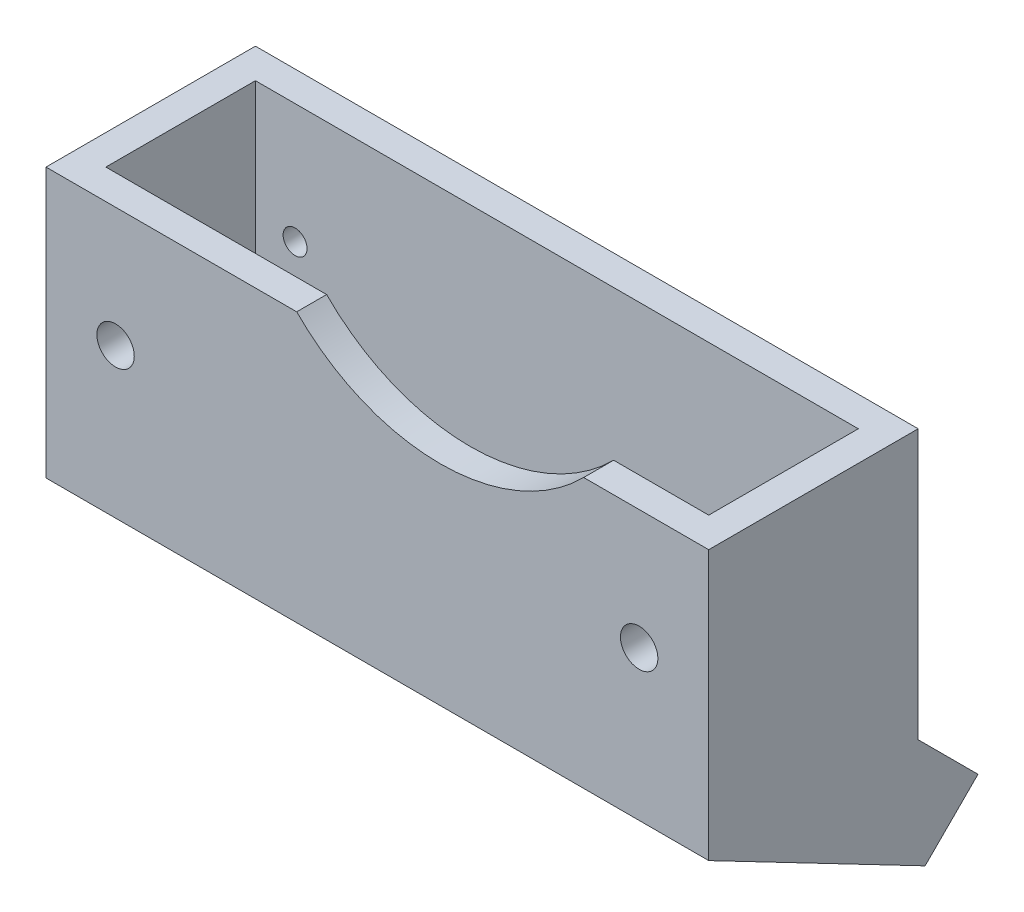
ISO-10303-21;
HEADER;
FILE_DESCRIPTION(('STEP AP214'),'2;1');
FILE_NAME('part.step','',(''),(''),'','','');
FILE_SCHEMA(('AUTOMOTIVE_DESIGN { 1 0 10303 214 1 1 1 1 }'));
ENDSEC;
DATA;
#1=APPLICATION_CONTEXT('core data for automotive mechanical design processes');
#2=APPLICATION_PROTOCOL_DEFINITION('international standard','automotive_design',2000,#1);
#3=PRODUCT_CONTEXT('',#1,'mechanical');
#4=PRODUCT('Part','Part','',(#3));
#5=PRODUCT_RELATED_PRODUCT_CATEGORY('part','',(#4));
#6=PRODUCT_DEFINITION_FORMATION('','',#4);
#7=PRODUCT_DEFINITION_CONTEXT('part definition',#1,'design');
#8=PRODUCT_DEFINITION('design','',#6,#7);
#9=PRODUCT_DEFINITION_SHAPE('','',#8);
#10=(LENGTH_UNIT() NAMED_UNIT(*) SI_UNIT(.MILLI.,.METRE.));
#11=(NAMED_UNIT(*) PLANE_ANGLE_UNIT() SI_UNIT($,.RADIAN.));
#12=(NAMED_UNIT(*) SI_UNIT($,.STERADIAN.) SOLID_ANGLE_UNIT());
#13=UNCERTAINTY_MEASURE_WITH_UNIT(LENGTH_MEASURE(1.E-05),#10,'distance_accuracy_value','');
#14=(GEOMETRIC_REPRESENTATION_CONTEXT(3) GLOBAL_UNCERTAINTY_ASSIGNED_CONTEXT((#13)) GLOBAL_UNIT_ASSIGNED_CONTEXT((#10,
#11,#12)) REPRESENTATION_CONTEXT('',''));
#15=CARTESIAN_POINT('',(0.,0.,0.));
#16=DIRECTION('',(0.,0.,1.));
#17=DIRECTION('',(1.,0.,0.));
#18=AXIS2_PLACEMENT_3D('',#15,#16,#17);
#19=CARTESIAN_POINT('',(-36.6402744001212,-23.,-10.));
#20=DIRECTION('',(0.,-0.707106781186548,0.707106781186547));
#21=DIRECTION('',(0.,-0.707106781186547,-0.707106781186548));
#22=AXIS2_PLACEMENT_3D('',#19,#20,#21);
#23=PLANE('',#22);
#24=DIRECTION('',(-0.885684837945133,0.328300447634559,0.328300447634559));
#25=VECTOR('',#24,1.);
#26=CARTESIAN_POINT('',(-21.7307374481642,-17.383159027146,-4.383159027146));
#27=LINE('',#26,#25);
#28=CARTESIAN_POINT('',(-8.15,-22.4171869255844,-9.41718692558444));
#29=VERTEX_POINT('',#28);
#30=CARTESIAN_POINT('',(-20.0666315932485,-18.,-5.));
#31=VERTEX_POINT('',#30);
#32=EDGE_CURVE('E63',#29,#31,#27,.T.);
#33=ORIENTED_EDGE('',*,*,#32,.F.);
#34=DIRECTION('',(0.,-0.707106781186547,-0.707106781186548));
#35=VECTOR('',#34,1.);
#36=CARTESIAN_POINT('',(-8.15,-23.0000000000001,-10.0000000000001));
#37=LINE('',#36,#35);
#38=CARTESIAN_POINT('',(-8.15,-23.,-10.));
#39=VERTEX_POINT('',#38);
#40=EDGE_CURVE('E58',#29,#39,#37,.T.);
#41=ORIENTED_EDGE('',*,*,#40,.T.);
#42=DIRECTION('',(1.,0.,0.));
#43=VECTOR('',#42,1.);
#44=CARTESIAN_POINT('',(-36.6402744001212,-23.,-10.));
#45=LINE('',#44,#43);
#46=CARTESIAN_POINT('',(8.15,-23.,-10.));
#47=VERTEX_POINT('',#46);
#48=EDGE_CURVE('E191',#39,#47,#45,.T.);
#49=ORIENTED_EDGE('',*,*,#48,.T.);
#50=DIRECTION('',(0.,0.707106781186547,0.707106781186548));
#51=VECTOR('',#50,1.);
#52=CARTESIAN_POINT('',(8.14999999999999,-23.0000000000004,-10.0000000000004));
#53=LINE('',#52,#51);
#54=CARTESIAN_POINT('',(8.15,-22.4171869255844,-9.41718692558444));
#55=VERTEX_POINT('',#54);
#56=EDGE_CURVE('E177',#47,#55,#53,.T.);
#57=ORIENTED_EDGE('',*,*,#56,.T.);
#58=DIRECTION('',(-0.885684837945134,-0.328300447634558,-0.328300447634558));
#59=VECTOR('',#58,1.);
#60=CARTESIAN_POINT('',(21.7307374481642,-17.383159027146,-4.38315902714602));
#61=LINE('',#60,#59);
#62=CARTESIAN_POINT('',(20.0666315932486,-18.,-5.));
#63=VERTEX_POINT('',#62);
#64=EDGE_CURVE('E216',#63,#55,#61,.T.);
#65=ORIENTED_EDGE('',*,*,#64,.F.);
#66=DIRECTION('',(-1.,0.,0.));
#67=VECTOR('',#66,1.);
#68=CARTESIAN_POINT('',(-20.15,-18.,-5.));
#69=LINE('',#68,#67);
#70=EDGE_CURVE('E315',#63,#31,#69,.T.);
#71=ORIENTED_EDGE('',*,*,#70,.T.);
#72=EDGE_LOOP('',(#33,#41,#49,#57,#65,#71));
#73=FACE_BOUND('',#72,.T.);
#74=ADVANCED_FACE('F40',(#73),#23,.T.);
#75=CARTESIAN_POINT('',(-36.6402744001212,-18.,5.));
#76=DIRECTION('',(0.,0.886864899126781,-0.462028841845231));
#77=DIRECTION('',(0.,0.462028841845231,0.886864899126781));
#78=AXIS2_PLACEMENT_3D('',#75,#76,#77);
#79=PLANE('',#78);
#80=DIRECTION('',(1.,0.,0.));
#81=VECTOR('',#80,1.);
#82=CARTESIAN_POINT('',(-36.6402744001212,-24.8504853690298,-8.14951463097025));
#83=LINE('',#82,#81);
#84=CARTESIAN_POINT('',(-8.15,-24.8504853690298,-8.14951463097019));
#85=VERTEX_POINT('',#84);
#86=CARTESIAN_POINT('',(8.14999999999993,-24.8504853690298,-8.14951463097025));
#87=VERTEX_POINT('',#86);
#88=EDGE_CURVE('E181',#85,#87,#83,.T.);
#89=ORIENTED_EDGE('',*,*,#88,.F.);
#90=DIRECTION('',(0.894427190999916,-0.206625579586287,-0.396618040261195));
#91=VECTOR('',#90,1.);
#92=CARTESIAN_POINT('',(-20.15,-22.0783123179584,-2.82832523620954));
#93=LINE('',#92,#91);
#94=CARTESIAN_POINT('',(-20.15,-22.0783123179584,-2.82832523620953));
#95=VERTEX_POINT('',#94);
#96=EDGE_CURVE('E167',#95,#85,#93,.T.);
#97=ORIENTED_EDGE('',*,*,#96,.F.);
#98=DIRECTION('',(0.,0.462028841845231,0.886864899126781));
#99=VECTOR('',#98,1.);
#100=CARTESIAN_POINT('',(-20.15,-18.,5.));
#101=LINE('',#100,#99);
#102=CARTESIAN_POINT('',(-20.15,-18.,5.));
#103=VERTEX_POINT('',#102);
#104=EDGE_CURVE('E244',#95,#103,#101,.T.);
#105=ORIENTED_EDGE('',*,*,#104,.T.);
#106=DIRECTION('',(1.,0.,0.));
#107=VECTOR('',#106,1.);
#108=CARTESIAN_POINT('',(-20.15,-18.,5.));
#109=LINE('',#108,#107);
#110=CARTESIAN_POINT('',(20.15,-18.,5.));
#111=VERTEX_POINT('',#110);
#112=EDGE_CURVE('E314',#103,#111,#109,.T.);
#113=ORIENTED_EDGE('',*,*,#112,.T.);
#114=DIRECTION('',(0.,0.462028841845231,0.886864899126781));
#115=VECTOR('',#114,1.);
#116=CARTESIAN_POINT('',(20.15,-18.,5.));
#117=LINE('',#116,#115);
#118=CARTESIAN_POINT('',(20.15,-22.0783123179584,-2.82832523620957));
#119=VERTEX_POINT('',#118);
#120=EDGE_CURVE('E190',#119,#111,#117,.T.);
#121=ORIENTED_EDGE('',*,*,#120,.F.);
#122=DIRECTION('',(0.894427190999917,0.206625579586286,0.396618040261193));
#123=VECTOR('',#122,1.);
#124=CARTESIAN_POINT('',(20.15,-22.0783123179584,-2.82832523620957));
#125=LINE('',#124,#123);
#126=EDGE_CURVE('E185',#87,#119,#125,.T.);
#127=ORIENTED_EDGE('',*,*,#126,.F.);
#128=EDGE_LOOP('',(#89,#97,#105,#113,#121,#127));
#129=FACE_BOUND('',#128,.T.);
#130=ADVANCED_FACE('F183',(#129),#79,.T.);
#131=CARTESIAN_POINT('',(-20.15,-18.,5.));
#132=DIRECTION('',(-1.,0.,0.));
#133=DIRECTION('',(0.,0.,1.));
#134=AXIS2_PLACEMENT_3D('',#131,#132,#133);
#135=PLANE('',#134);
#136=DIRECTION('',(0.,-0.886864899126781,0.462028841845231));
#137=VECTOR('',#136,1.);
#138=CARTESIAN_POINT('',(-20.15,-6.62042262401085,-10.8814017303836));
#139=LINE('',#138,#137);
#140=CARTESIAN_POINT('',(-20.15,-17.9690974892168,-4.96909748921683));
#141=VERTEX_POINT('',#140);
#142=EDGE_CURVE('E173',#141,#95,#139,.T.);
#143=ORIENTED_EDGE('',*,*,#142,.F.);
#144=DIRECTION('',(0.,-0.707106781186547,-0.707106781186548));
#145=VECTOR('',#144,1.);
#146=CARTESIAN_POINT('',(-20.15,-19.2975934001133,-6.29759340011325));
#147=LINE('',#146,#145);
#148=CARTESIAN_POINT('',(-20.15,-18.,-5.));
#149=VERTEX_POINT('',#148);
#150=EDGE_CURVE('E202',#141,#149,#147,.T.);
#151=ORIENTED_EDGE('',*,*,#150,.T.);
#152=DIRECTION('',(0.,1.,0.));
#153=VECTOR('',#152,1.);
#154=CARTESIAN_POINT('',(-20.15,-18.,-5.));
#155=LINE('',#154,#153);
#156=CARTESIAN_POINT('',(-20.15,0.,-5.));
#157=VERTEX_POINT('',#156);
#158=EDGE_CURVE('E344',#149,#157,#155,.T.);
#159=ORIENTED_EDGE('',*,*,#158,.T.);
#160=DIRECTION('',(0.,0.,1.));
#161=VECTOR('',#160,1.);
#162=CARTESIAN_POINT('',(-20.15,0.,5.));
#163=LINE('',#162,#161);
#164=CARTESIAN_POINT('',(-20.15,0.,5.));
#165=VERTEX_POINT('',#164);
#166=EDGE_CURVE('E327',#157,#165,#163,.T.);
#167=ORIENTED_EDGE('',*,*,#166,.T.);
#168=DIRECTION('',(0.,1.,0.));
#169=VECTOR('',#168,1.);
#170=CARTESIAN_POINT('',(-20.15,-18.,5.));
#171=LINE('',#170,#169);
#172=EDGE_CURVE('E341',#103,#165,#171,.T.);
#173=ORIENTED_EDGE('',*,*,#172,.F.);
#174=ORIENTED_EDGE('',*,*,#104,.F.);
#175=EDGE_LOOP('',(#143,#151,#159,#167,#173,#174));
#176=FACE_BOUND('',#175,.T.);
#177=ADVANCED_FACE('F424',(#176),#135,.F.);
#178=CARTESIAN_POINT('',(20.15,-18.,5.));
#179=DIRECTION('',(1.,0.,0.));
#180=DIRECTION('',(0.,0.,-1.));
#181=AXIS2_PLACEMENT_3D('',#178,#179,#180);
#182=PLANE('',#181);
#183=DIRECTION('',(0.,-0.886864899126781,0.462028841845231));
#184=VECTOR('',#183,1.);
#185=CARTESIAN_POINT('',(20.15,-6.62042262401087,-10.8814017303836));
#186=LINE('',#185,#184);
#187=CARTESIAN_POINT('',(20.15,-17.9690974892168,-4.96909748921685));
#188=VERTEX_POINT('',#187);
#189=EDGE_CURVE('E217',#188,#119,#186,.T.);
#190=ORIENTED_EDGE('',*,*,#189,.T.);
#191=ORIENTED_EDGE('',*,*,#120,.T.);
#192=DIRECTION('',(0.,1.,0.));
#193=VECTOR('',#192,1.);
#194=CARTESIAN_POINT('',(20.15,-18.,5.));
#195=LINE('',#194,#193);
#196=CARTESIAN_POINT('',(20.15,0.,5.));
#197=VERTEX_POINT('',#196);
#198=EDGE_CURVE('E336',#111,#197,#195,.T.);
#199=ORIENTED_EDGE('',*,*,#198,.T.);
#200=DIRECTION('',(0.,0.,-1.));
#201=VECTOR('',#200,1.);
#202=CARTESIAN_POINT('',(20.15,0.,5.));
#203=LINE('',#202,#201);
#204=CARTESIAN_POINT('',(20.15,0.,-5.));
#205=VERTEX_POINT('',#204);
#206=EDGE_CURVE('E310',#197,#205,#203,.T.);
#207=ORIENTED_EDGE('',*,*,#206,.T.);
#208=DIRECTION('',(0.,1.,0.));
#209=VECTOR('',#208,1.);
#210=CARTESIAN_POINT('',(20.15,-18.,-5.));
#211=LINE('',#210,#209);
#212=CARTESIAN_POINT('',(20.15,-18.,-5.));
#213=VERTEX_POINT('',#212);
#214=EDGE_CURVE('E320',#213,#205,#211,.T.);
#215=ORIENTED_EDGE('',*,*,#214,.F.);
#216=DIRECTION('',(0.,0.707106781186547,0.707106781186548));
#217=VECTOR('',#216,1.);
#218=CARTESIAN_POINT('',(20.15,-19.2975934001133,-6.29759340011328));
#219=LINE('',#218,#217);
#220=EDGE_CURVE('E212',#213,#188,#219,.T.);
#221=ORIENTED_EDGE('',*,*,#220,.T.);
#222=EDGE_LOOP('',(#190,#191,#199,#207,#215,#221));
#223=FACE_BOUND('',#222,.T.);
#224=ADVANCED_FACE('F433',(#223),#182,.F.);
#225=CARTESIAN_POINT('',(41.6636944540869,-22.,-11.));
#226=DIRECTION('',(0.,-0.707106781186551,-0.707106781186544));
#227=DIRECTION('',(0.,0.707106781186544,-0.707106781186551));
#228=AXIS2_PLACEMENT_3D('',#225,#226,#227);
#229=PLANE('',#228);
#230=ORIENTED_EDGE('',*,*,#48,.F.);
#231=DIRECTION('',(0.,-0.707106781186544,0.707106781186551));
#232=VECTOR('',#231,1.);
#233=CARTESIAN_POINT('',(-8.15,-20.2301152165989,-12.7698847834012));
#234=LINE('',#233,#232);
#235=EDGE_CURVE('E194',#39,#85,#234,.T.);
#236=ORIENTED_EDGE('',*,*,#235,.T.);
#237=ORIENTED_EDGE('',*,*,#88,.T.);
#238=DIRECTION('',(0.,0.707106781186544,-0.707106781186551));
#239=VECTOR('',#238,1.);
#240=CARTESIAN_POINT('',(8.15000000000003,-22.0806005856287,-10.9193994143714));
#241=LINE('',#240,#239);
#242=EDGE_CURVE('E485',#87,#47,#241,.T.);
#243=ORIENTED_EDGE('',*,*,#242,.T.);
#244=EDGE_LOOP('',(#230,#236,#237,#243));
#245=FACE_BOUND('',#244,.T.);
#246=DIRECTION('',(-1.,0.,0.));
#247=VECTOR('',#246,1.);
#248=CARTESIAN_POINT('',(41.6636944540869,-22.,-11.));
#249=LINE('',#248,#247);
#250=CARTESIAN_POINT('',(22.15,-22.,-11.));
#251=VERTEX_POINT('',#250);
#252=CARTESIAN_POINT('',(-22.15,-22.,-11.));
#253=VERTEX_POINT('',#252);
#254=EDGE_CURVE('E265',#251,#253,#249,.T.);
#255=ORIENTED_EDGE('',*,*,#254,.F.);
#256=DIRECTION('',(0.,-0.707106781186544,0.707106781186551));
#257=VECTOR('',#256,1.);
#258=CARTESIAN_POINT('',(22.15,-22.,-11.));
#259=LINE('',#258,#257);
#260=CARTESIAN_POINT('',(22.15,-25.5355339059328,-7.46446609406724));
#261=VERTEX_POINT('',#260);
#262=EDGE_CURVE('E271',#251,#261,#259,.T.);
#263=ORIENTED_EDGE('',*,*,#262,.T.);
#264=DIRECTION('',(-1.,0.,0.));
#265=VECTOR('',#264,1.);
#266=CARTESIAN_POINT('',(41.6636944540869,-25.5355339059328,-7.46446609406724));
#267=LINE('',#266,#265);
#268=CARTESIAN_POINT('',(-22.15,-25.5355339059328,-7.46446609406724));
#269=VERTEX_POINT('',#268);
#270=EDGE_CURVE('E270',#261,#269,#267,.T.);
#271=ORIENTED_EDGE('',*,*,#270,.T.);
#272=DIRECTION('',(0.,-0.707106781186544,0.707106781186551));
#273=VECTOR('',#272,1.);
#274=CARTESIAN_POINT('',(-22.15,-22.,-11.));
#275=LINE('',#274,#273);
#276=EDGE_CURVE('E255',#253,#269,#275,.T.);
#277=ORIENTED_EDGE('',*,*,#276,.F.);
#278=EDGE_LOOP('',(#255,#263,#271,#277));
#279=FACE_BOUND('',#278,.T.);
#280=ADVANCED_FACE('F195',(#245,#279),#229,.T.);
#281=CARTESIAN_POINT('',(22.15,-18.,7.));
#282=DIRECTION('',(1.,0.,0.));
#283=DIRECTION('',(0.,0.,-1.));
#284=AXIS2_PLACEMENT_3D('',#281,#282,#283);
#285=PLANE('',#284);
#286=DIRECTION('',(0.,0.,-1.));
#287=VECTOR('',#286,1.);
#288=CARTESIAN_POINT('',(22.15,0.,7.));
#289=LINE('',#288,#287);
#290=CARTESIAN_POINT('',(22.15,0.,7.));
#291=VERTEX_POINT('',#290);
#292=CARTESIAN_POINT('',(22.15,0.,-7.));
#293=VERTEX_POINT('',#292);
#294=EDGE_CURVE('E340',#291,#293,#289,.T.);
#295=ORIENTED_EDGE('',*,*,#294,.F.);
#296=DIRECTION('',(0.,1.,0.));
#297=VECTOR('',#296,1.);
#298=CARTESIAN_POINT('',(22.15,-18.,7.));
#299=LINE('',#298,#297);
#300=CARTESIAN_POINT('',(22.15,-18.,7.));
#301=VERTEX_POINT('',#300);
#302=EDGE_CURVE('E11',#301,#291,#299,.T.);
#303=ORIENTED_EDGE('',*,*,#302,.F.);
#304=DIRECTION('',(0.,0.462028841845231,0.886864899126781));
#305=VECTOR('',#304,1.);
#306=CARTESIAN_POINT('',(22.15,-25.5355339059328,-7.46446609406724));
#307=LINE('',#306,#305);
#308=EDGE_CURVE('E266',#261,#301,#307,.T.);
#309=ORIENTED_EDGE('',*,*,#308,.F.);
#310=ORIENTED_EDGE('',*,*,#262,.F.);
#311=DIRECTION('',(0.,-0.707106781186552,-0.707106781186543));
#312=VECTOR('',#311,1.);
#313=CARTESIAN_POINT('',(22.15,-18.,-7.));
#314=LINE('',#313,#312);
#315=CARTESIAN_POINT('',(22.15,-18.,-7.));
#316=VERTEX_POINT('',#315);
#317=EDGE_CURVE('E254',#316,#251,#314,.T.);
#318=ORIENTED_EDGE('',*,*,#317,.F.);
#319=DIRECTION('',(0.,1.,0.));
#320=VECTOR('',#319,1.);
#321=CARTESIAN_POINT('',(22.15,-18.,-7.));
#322=LINE('',#321,#320);
#323=EDGE_CURVE('E44',#316,#293,#322,.T.);
#324=ORIENTED_EDGE('',*,*,#323,.T.);
#325=EDGE_LOOP('',(#295,#303,#309,#310,#318,#324));
#326=FACE_BOUND('',#325,.T.);
#327=ADVANCED_FACE('F42',(#326),#285,.T.);
#328=CARTESIAN_POINT('',(-22.15,-18.,7.));
#329=DIRECTION('',(0.,0.,1.));
#330=DIRECTION('',(1.,0.,0.));
#331=AXIS2_PLACEMENT_3D('',#328,#329,#330);
#332=PLANE('',#331);
#333=CARTESIAN_POINT('',(4.20000000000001,9.5,7.));
#334=DIRECTION('',(0.,0.,1.));
#335=DIRECTION('',(1.,0.,0.));
#336=AXIS2_PLACEMENT_3D('',#333,#334,#335);
#337=CIRCLE('',#336,13.5);
#338=CARTESIAN_POINT('',(-5.39166304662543,0.,7.));
#339=VERTEX_POINT('',#338);
#340=CARTESIAN_POINT('',(13.7916630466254,0.,7.));
#341=VERTEX_POINT('',#340);
#342=EDGE_CURVE('E236',#339,#341,#337,.T.);
#343=ORIENTED_EDGE('',*,*,#342,.F.);
#344=DIRECTION('',(1.,0.,0.));
#345=VECTOR('',#344,1.);
#346=CARTESIAN_POINT('',(-22.15,0.,7.));
#347=LINE('',#346,#345);
#348=CARTESIAN_POINT('',(-22.15,0.,7.));
#349=VERTEX_POINT('',#348);
#350=EDGE_CURVE('E355',#349,#339,#347,.T.);
#351=ORIENTED_EDGE('',*,*,#350,.F.);
#352=DIRECTION('',(0.,1.,0.));
#353=VECTOR('',#352,1.);
#354=CARTESIAN_POINT('',(-22.15,-18.,7.));
#355=LINE('',#354,#353);
#356=CARTESIAN_POINT('',(-22.15,-18.,7.));
#357=VERTEX_POINT('',#356);
#358=EDGE_CURVE('E50',#357,#349,#355,.T.);
#359=ORIENTED_EDGE('',*,*,#358,.F.);
#360=DIRECTION('',(1.,0.,0.));
#361=VECTOR('',#360,1.);
#362=CARTESIAN_POINT('',(-22.15,-18.,7.));
#363=LINE('',#362,#361);
#364=EDGE_CURVE('E354',#357,#301,#363,.T.);
#365=ORIENTED_EDGE('',*,*,#364,.T.);
#366=ORIENTED_EDGE('',*,*,#302,.T.);
#367=EDGE_CURVE('E370',#341,#291,#347,.T.);
#368=ORIENTED_EDGE('',*,*,#367,.F.);
#369=EDGE_LOOP('',(#343,#351,#359,#365,#366,#368));
#370=FACE_BOUND('',#369,.T.);
#371=CARTESIAN_POINT('',(-17.5,-8.,7.));
#372=DIRECTION('',(0.,0.,1.));
#373=DIRECTION('',(1.,0.,0.));
#374=AXIS2_PLACEMENT_3D('',#371,#372,#373);
#375=CIRCLE('',#374,1.24999999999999);
#376=CARTESIAN_POINT('',(-16.25,-8.,7.));
#377=VERTEX_POINT('',#376);
#378=EDGE_CURVE('E294',#377,#377,#375,.T.);
#379=ORIENTED_EDGE('',*,*,#378,.F.);
#380=EDGE_LOOP('',(#379));
#381=FACE_BOUND('',#380,.T.);
#382=CARTESIAN_POINT('',(17.5,-8.,7.));
#383=DIRECTION('',(0.,0.,1.));
#384=DIRECTION('',(1.,0.,0.));
#385=AXIS2_PLACEMENT_3D('',#382,#383,#384);
#386=CIRCLE('',#385,1.24999999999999);
#387=CARTESIAN_POINT('',(18.75,-8.,7.));
#388=VERTEX_POINT('',#387);
#389=EDGE_CURVE('E302',#388,#388,#386,.T.);
#390=ORIENTED_EDGE('',*,*,#389,.F.);
#391=EDGE_LOOP('',(#390));
#392=FACE_BOUND('',#391,.T.);
#393=ADVANCED_FACE('F398',(#370,#381,#392),#332,.T.);
#394=CARTESIAN_POINT('',(-22.15,-18.,7.));
#395=DIRECTION('',(-1.,0.,0.));
#396=DIRECTION('',(0.,0.,1.));
#397=AXIS2_PLACEMENT_3D('',#394,#395,#396);
#398=PLANE('',#397);
#399=DIRECTION('',(0.,0.,1.));
#400=VECTOR('',#399,1.);
#401=CARTESIAN_POINT('',(-22.15,0.,7.));
#402=LINE('',#401,#400);
#403=CARTESIAN_POINT('',(-22.15,0.,-7.));
#404=VERTEX_POINT('',#403);
#405=EDGE_CURVE('E366',#404,#349,#402,.T.);
#406=ORIENTED_EDGE('',*,*,#405,.F.);
#407=DIRECTION('',(0.,1.,0.));
#408=VECTOR('',#407,1.);
#409=CARTESIAN_POINT('',(-22.15,-18.,-7.));
#410=LINE('',#409,#408);
#411=CARTESIAN_POINT('',(-22.15,-18.,-7.));
#412=VERTEX_POINT('',#411);
#413=EDGE_CURVE('E375',#412,#404,#410,.T.);
#414=ORIENTED_EDGE('',*,*,#413,.F.);
#415=DIRECTION('',(0.,-0.707106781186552,-0.707106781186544));
#416=VECTOR('',#415,1.);
#417=CARTESIAN_POINT('',(-22.15,-18.,-7.));
#418=LINE('',#417,#416);
#419=EDGE_CURVE('E247',#412,#253,#418,.T.);
#420=ORIENTED_EDGE('',*,*,#419,.T.);
#421=ORIENTED_EDGE('',*,*,#276,.T.);
#422=DIRECTION('',(0.,0.462028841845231,0.886864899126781));
#423=VECTOR('',#422,1.);
#424=CARTESIAN_POINT('',(-22.15,-25.5355339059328,-7.46446609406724));
#425=LINE('',#424,#423);
#426=EDGE_CURVE('E250',#269,#357,#425,.T.);
#427=ORIENTED_EDGE('',*,*,#426,.T.);
#428=ORIENTED_EDGE('',*,*,#358,.T.);
#429=EDGE_LOOP('',(#406,#414,#420,#421,#427,#428));
#430=FACE_BOUND('',#429,.T.);
#431=ADVANCED_FACE('F410',(#430),#398,.T.);
#432=CARTESIAN_POINT('',(-22.15,-18.,-7.));
#433=DIRECTION('',(0.,0.,-1.));
#434=DIRECTION('',(-1.,0.,0.));
#435=AXIS2_PLACEMENT_3D('',#432,#433,#434);
#436=PLANE('',#435);
#437=CARTESIAN_POINT('',(-17.5,-8.,-7.));
#438=DIRECTION('',(0.,0.,-1.));
#439=DIRECTION('',(-1.,0.,0.));
#440=AXIS2_PLACEMENT_3D('',#437,#438,#439);
#441=CIRCLE('',#440,0.799999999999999);
#442=CARTESIAN_POINT('',(-18.3,-8.,-7.));
#443=VERTEX_POINT('',#442);
#444=EDGE_CURVE('E282',#443,#443,#441,.T.);
#445=ORIENTED_EDGE('',*,*,#444,.F.);
#446=EDGE_LOOP('',(#445));
#447=FACE_BOUND('',#446,.T.);
#448=CARTESIAN_POINT('',(17.5,-8.,-7.));
#449=DIRECTION('',(0.,0.,-1.));
#450=DIRECTION('',(-1.,0.,0.));
#451=AXIS2_PLACEMENT_3D('',#448,#449,#450);
#452=CIRCLE('',#451,0.799999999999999);
#453=CARTESIAN_POINT('',(16.7,-8.,-7.));
#454=VERTEX_POINT('',#453);
#455=EDGE_CURVE('E290',#454,#454,#452,.T.);
#456=ORIENTED_EDGE('',*,*,#455,.F.);
#457=EDGE_LOOP('',(#456));
#458=FACE_BOUND('',#457,.T.);
#459=DIRECTION('',(-1.,0.,0.));
#460=VECTOR('',#459,1.);
#461=CARTESIAN_POINT('',(-22.15,0.,-7.));
#462=LINE('',#461,#460);
#463=EDGE_CURVE('E362',#293,#404,#462,.T.);
#464=ORIENTED_EDGE('',*,*,#463,.F.);
#465=ORIENTED_EDGE('',*,*,#323,.F.);
#466=DIRECTION('',(-1.,0.,0.));
#467=VECTOR('',#466,1.);
#468=CARTESIAN_POINT('',(-22.15,-18.,-7.));
#469=LINE('',#468,#467);
#470=EDGE_CURVE('E350',#316,#412,#469,.T.);
#471=ORIENTED_EDGE('',*,*,#470,.T.);
#472=ORIENTED_EDGE('',*,*,#413,.T.);
#473=EDGE_LOOP('',(#464,#465,#471,#472));
#474=FACE_BOUND('',#473,.T.);
#475=ADVANCED_FACE('F389',(#447,#458,#474),#436,.T.);
#476=CARTESIAN_POINT('',(0.,0.,0.));
#477=DIRECTION('',(0.,-1.,0.));
#478=DIRECTION('',(0.,0.,-1.));
#479=AXIS2_PLACEMENT_3D('',#476,#477,#478);
#480=PLANE('',#479);
#481=DIRECTION('',(1.,0.,0.));
#482=VECTOR('',#481,1.);
#483=CARTESIAN_POINT('',(-20.15,0.,5.));
#484=LINE('',#483,#482);
#485=CARTESIAN_POINT('',(13.7916630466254,0.,5.));
#486=VERTEX_POINT('',#485);
#487=EDGE_CURVE('E331',#486,#197,#484,.T.);
#488=ORIENTED_EDGE('',*,*,#487,.F.);
#489=DIRECTION('',(0.,0.,1.));
#490=VECTOR('',#489,1.);
#491=CARTESIAN_POINT('',(13.7916630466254,0.,-11.001));
#492=LINE('',#491,#490);
#493=EDGE_CURVE('E233',#341,#486,#492,.F.);
#494=ORIENTED_EDGE('',*,*,#493,.F.);
#495=ORIENTED_EDGE('',*,*,#367,.T.);
#496=ORIENTED_EDGE('',*,*,#294,.T.);
#497=ORIENTED_EDGE('',*,*,#463,.T.);
#498=ORIENTED_EDGE('',*,*,#405,.T.);
#499=ORIENTED_EDGE('',*,*,#350,.T.);
#500=DIRECTION('',(0.,0.,1.));
#501=VECTOR('',#500,1.);
#502=CARTESIAN_POINT('',(-5.39166304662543,0.,-11.001));
#503=LINE('',#502,#501);
#504=CARTESIAN_POINT('',(-5.39166304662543,0.,5.));
#505=VERTEX_POINT('',#504);
#506=EDGE_CURVE('E222',#505,#339,#503,.T.);
#507=ORIENTED_EDGE('',*,*,#506,.F.);
#508=EDGE_CURVE('E332',#165,#505,#484,.T.);
#509=ORIENTED_EDGE('',*,*,#508,.F.);
#510=ORIENTED_EDGE('',*,*,#166,.F.);
#511=DIRECTION('',(-1.,0.,0.));
#512=VECTOR('',#511,1.);
#513=CARTESIAN_POINT('',(-20.15,0.,-5.));
#514=LINE('',#513,#512);
#515=EDGE_CURVE('E323',#205,#157,#514,.T.);
#516=ORIENTED_EDGE('',*,*,#515,.F.);
#517=ORIENTED_EDGE('',*,*,#206,.F.);
#518=EDGE_LOOP('',(#488,#494,#495,#496,#497,#498,#499,#507,#509,#510,#516,#517));
#519=FACE_BOUND('',#518,.T.);
#520=ADVANCED_FACE('F392',(#519),#480,.F.);
#521=CARTESIAN_POINT('',(-20.15,-18.,5.));
#522=DIRECTION('',(0.,0.,1.));
#523=DIRECTION('',(1.,0.,0.));
#524=AXIS2_PLACEMENT_3D('',#521,#522,#523);
#525=PLANE('',#524);
#526=CARTESIAN_POINT('',(-17.5,-8.,5.));
#527=DIRECTION('',(0.,0.,1.));
#528=DIRECTION('',(1.,0.,0.));
#529=AXIS2_PLACEMENT_3D('',#526,#527,#528);
#530=CIRCLE('',#529,1.24999999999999);
#531=CARTESIAN_POINT('',(-16.25,-8.,5.));
#532=VERTEX_POINT('',#531);
#533=EDGE_CURVE('E298',#532,#532,#530,.T.);
#534=ORIENTED_EDGE('',*,*,#533,.T.);
#535=EDGE_LOOP('',(#534));
#536=FACE_BOUND('',#535,.T.);
#537=CARTESIAN_POINT('',(17.5,-8.,5.));
#538=DIRECTION('',(0.,0.,1.));
#539=DIRECTION('',(1.,0.,0.));
#540=AXIS2_PLACEMENT_3D('',#537,#538,#539);
#541=CIRCLE('',#540,1.24999999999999);
#542=CARTESIAN_POINT('',(18.75,-8.,5.));
#543=VERTEX_POINT('',#542);
#544=EDGE_CURVE('E306',#543,#543,#541,.T.);
#545=ORIENTED_EDGE('',*,*,#544,.T.);
#546=EDGE_LOOP('',(#545));
#547=FACE_BOUND('',#546,.T.);
#548=ORIENTED_EDGE('',*,*,#508,.T.);
#549=CARTESIAN_POINT('',(4.20000000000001,9.5,5.));
#550=DIRECTION('',(0.,0.,1.));
#551=DIRECTION('',(1.,0.,0.));
#552=AXIS2_PLACEMENT_3D('',#549,#550,#551);
#553=CIRCLE('',#552,13.5);
#554=EDGE_CURVE('E239',#486,#505,#553,.F.);
#555=ORIENTED_EDGE('',*,*,#554,.F.);
#556=ORIENTED_EDGE('',*,*,#487,.T.);
#557=ORIENTED_EDGE('',*,*,#198,.F.);
#558=ORIENTED_EDGE('',*,*,#112,.F.);
#559=ORIENTED_EDGE('',*,*,#172,.T.);
#560=EDGE_LOOP('',(#548,#555,#556,#557,#558,#559));
#561=FACE_BOUND('',#560,.T.);
#562=ADVANCED_FACE('F419',(#536,#547,#561),#525,.F.);
#563=CARTESIAN_POINT('',(-20.15,-18.,-5.));
#564=DIRECTION('',(0.,0.,-1.));
#565=DIRECTION('',(-1.,0.,0.));
#566=AXIS2_PLACEMENT_3D('',#563,#564,#565);
#567=PLANE('',#566);
#568=CARTESIAN_POINT('',(-17.5,-8.,-5.));
#569=DIRECTION('',(0.,0.,1.));
#570=DIRECTION('',(1.,0.,0.));
#571=AXIS2_PLACEMENT_3D('',#568,#569,#570);
#572=CIRCLE('',#571,0.799999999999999);
#573=CARTESIAN_POINT('',(-16.7,-8.,-5.));
#574=VERTEX_POINT('',#573);
#575=EDGE_CURVE('E269',#574,#574,#572,.T.);
#576=ORIENTED_EDGE('',*,*,#575,.F.);
#577=EDGE_LOOP('',(#576));
#578=FACE_BOUND('',#577,.T.);
#579=CARTESIAN_POINT('',(17.5,-8.,-5.));
#580=DIRECTION('',(0.,0.,1.));
#581=DIRECTION('',(1.,0.,0.));
#582=AXIS2_PLACEMENT_3D('',#579,#580,#581);
#583=CIRCLE('',#582,0.799999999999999);
#584=CARTESIAN_POINT('',(18.3,-8.,-5.));
#585=VERTEX_POINT('',#584);
#586=EDGE_CURVE('E286',#585,#585,#583,.T.);
#587=ORIENTED_EDGE('',*,*,#586,.F.);
#588=EDGE_LOOP('',(#587));
#589=FACE_BOUND('',#588,.T.);
#590=ORIENTED_EDGE('',*,*,#515,.T.);
#591=ORIENTED_EDGE('',*,*,#158,.F.);
#592=EDGE_CURVE('E316',#31,#149,#69,.T.);
#593=ORIENTED_EDGE('',*,*,#592,.F.);
#594=ORIENTED_EDGE('',*,*,#70,.F.);
#595=EDGE_CURVE('E311',#213,#63,#69,.T.);
#596=ORIENTED_EDGE('',*,*,#595,.F.);
#597=ORIENTED_EDGE('',*,*,#214,.T.);
#598=EDGE_LOOP('',(#590,#591,#593,#594,#596,#597));
#599=FACE_BOUND('',#598,.T.);
#600=ADVANCED_FACE('F428',(#578,#589,#599),#567,.F.);
#601=CARTESIAN_POINT('',(17.5,-8.,7.));
#602=DIRECTION('',(0.,0.,1.));
#603=DIRECTION('',(1.,0.,0.));
#604=AXIS2_PLACEMENT_3D('',#601,#602,#603);
#605=CYLINDRICAL_SURFACE('',#604,1.24999999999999);
#606=ORIENTED_EDGE('',*,*,#544,.F.);
#607=EDGE_LOOP('',(#606));
#608=FACE_BOUND('',#607,.T.);
#609=ORIENTED_EDGE('',*,*,#389,.T.);
#610=EDGE_LOOP('',(#609));
#611=FACE_BOUND('',#610,.T.);
#612=ADVANCED_FACE('F538',(#608,#611),#605,.F.);
#613=CARTESIAN_POINT('',(-17.5,-8.,7.));
#614=DIRECTION('',(0.,0.,1.));
#615=DIRECTION('',(1.,0.,0.));
#616=AXIS2_PLACEMENT_3D('',#613,#614,#615);
#617=CYLINDRICAL_SURFACE('',#616,1.24999999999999);
#618=ORIENTED_EDGE('',*,*,#533,.F.);
#619=EDGE_LOOP('',(#618));
#620=FACE_BOUND('',#619,.T.);
#621=ORIENTED_EDGE('',*,*,#378,.T.);
#622=EDGE_LOOP('',(#621));
#623=FACE_BOUND('',#622,.T.);
#624=ADVANCED_FACE('F534',(#620,#623),#617,.F.);
#625=CARTESIAN_POINT('',(17.5,-8.,-5.));
#626=DIRECTION('',(0.,0.,1.));
#627=DIRECTION('',(1.,0.,0.));
#628=AXIS2_PLACEMENT_3D('',#625,#626,#627);
#629=CYLINDRICAL_SURFACE('',#628,0.799999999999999);
#630=ORIENTED_EDGE('',*,*,#586,.T.);
#631=EDGE_LOOP('',(#630));
#632=FACE_BOUND('',#631,.T.);
#633=ORIENTED_EDGE('',*,*,#455,.T.);
#634=EDGE_LOOP('',(#633));
#635=FACE_BOUND('',#634,.T.);
#636=ADVANCED_FACE('F530',(#632,#635),#629,.F.);
#637=CARTESIAN_POINT('',(-17.5,-8.,-5.));
#638=DIRECTION('',(0.,0.,1.));
#639=DIRECTION('',(1.,0.,0.));
#640=AXIS2_PLACEMENT_3D('',#637,#638,#639);
#641=CYLINDRICAL_SURFACE('',#640,0.799999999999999);
#642=ORIENTED_EDGE('',*,*,#575,.T.);
#643=EDGE_LOOP('',(#642));
#644=FACE_BOUND('',#643,.T.);
#645=ORIENTED_EDGE('',*,*,#444,.T.);
#646=EDGE_LOOP('',(#645));
#647=FACE_BOUND('',#646,.T.);
#648=ADVANCED_FACE('F527',(#644,#647),#641,.F.);
#649=CARTESIAN_POINT('',(41.6636944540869,-18.,-7.));
#650=DIRECTION('',(0.,0.707106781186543,-0.707106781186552));
#651=DIRECTION('',(0.,0.707106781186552,0.707106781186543));
#652=AXIS2_PLACEMENT_3D('',#649,#650,#651);
#653=PLANE('',#652);
#654=ORIENTED_EDGE('',*,*,#470,.F.);
#655=ORIENTED_EDGE('',*,*,#317,.T.);
#656=ORIENTED_EDGE('',*,*,#254,.T.);
#657=ORIENTED_EDGE('',*,*,#419,.F.);
#658=EDGE_LOOP('',(#654,#655,#656,#657));
#659=FACE_BOUND('',#658,.T.);
#660=ADVANCED_FACE('F408',(#659),#653,.T.);
#661=CARTESIAN_POINT('',(41.6636944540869,-25.5355339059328,-7.46446609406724));
#662=DIRECTION('',(0.,-0.886864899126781,0.462028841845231));
#663=DIRECTION('',(0.,-0.462028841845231,-0.886864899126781));
#664=AXIS2_PLACEMENT_3D('',#661,#662,#663);
#665=PLANE('',#664);
#666=ORIENTED_EDGE('',*,*,#270,.F.);
#667=ORIENTED_EDGE('',*,*,#308,.T.);
#668=ORIENTED_EDGE('',*,*,#364,.F.);
#669=ORIENTED_EDGE('',*,*,#426,.F.);
#670=EDGE_LOOP('',(#666,#667,#668,#669));
#671=FACE_BOUND('',#670,.T.);
#672=ADVANCED_FACE('F405',(#671),#665,.T.);
#673=CARTESIAN_POINT('',(4.20000000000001,9.5,-11.001));
#674=DIRECTION('',(0.,0.,1.));
#675=DIRECTION('',(1.,0.,0.));
#676=AXIS2_PLACEMENT_3D('',#673,#674,#675);
#677=CYLINDRICAL_SURFACE('',#676,13.5);
#678=ORIENTED_EDGE('',*,*,#493,.T.);
#679=ORIENTED_EDGE('',*,*,#554,.T.);
#680=ORIENTED_EDGE('',*,*,#506,.T.);
#681=ORIENTED_EDGE('',*,*,#342,.T.);
#682=EDGE_LOOP('',(#678,#679,#680,#681));
#683=FACE_BOUND('',#682,.T.);
#684=ADVANCED_FACE('F414',(#683),#677,.F.);
#685=CARTESIAN_POINT('',(-36.6402744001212,-23.,-10.));
#686=DIRECTION('',(0.,-0.707106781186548,0.707106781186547));
#687=DIRECTION('',(0.,-0.707106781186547,-0.707106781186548));
#688=AXIS2_PLACEMENT_3D('',#685,#686,#687);
#689=PLANE('',#688);
#690=ORIENTED_EDGE('',*,*,#220,.F.);
#691=ORIENTED_EDGE('',*,*,#595,.T.);
#692=EDGE_CURVE('E218',#188,#63,#61,.T.);
#693=ORIENTED_EDGE('',*,*,#692,.F.);
#694=EDGE_LOOP('',(#690,#691,#693));
#695=FACE_BOUND('',#694,.T.);
#696=ADVANCED_FACE('F503',(#695),#689,.F.);
#697=CARTESIAN_POINT('',(20.15,-6.62042262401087,-10.8814017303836));
#698=DIRECTION('',(0.447213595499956,-0.413251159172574,-0.793236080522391));
#699=DIRECTION('',(-0.871097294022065,0.,-0.491110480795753));
#700=AXIS2_PLACEMENT_3D('',#697,#698,#699);
#701=PLANE('',#700);
#702=ORIENTED_EDGE('',*,*,#189,.F.);
#703=ORIENTED_EDGE('',*,*,#692,.T.);
#704=ORIENTED_EDGE('',*,*,#64,.T.);
#705=DIRECTION('',(0.,-0.886864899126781,0.462028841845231));
#706=VECTOR('',#705,1.);
#707=CARTESIAN_POINT('',(8.15,-9.39259567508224,-16.2025911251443));
#708=LINE('',#707,#706);
#709=EDGE_CURVE('E225',#55,#87,#708,.T.);
#710=ORIENTED_EDGE('',*,*,#709,.T.);
#711=ORIENTED_EDGE('',*,*,#126,.T.);
#712=EDGE_LOOP('',(#702,#703,#704,#710,#711));
#713=FACE_BOUND('',#712,.T.);
#714=ADVANCED_FACE('F501',(#713),#701,.F.);
#715=CARTESIAN_POINT('',(-36.6402744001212,-23.,-10.));
#716=DIRECTION('',(0.,-0.707106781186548,0.707106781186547));
#717=DIRECTION('',(0.,-0.707106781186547,-0.707106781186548));
#718=AXIS2_PLACEMENT_3D('',#715,#716,#717);
#719=PLANE('',#718);
#720=EDGE_CURVE('E208',#31,#141,#27,.T.);
#721=ORIENTED_EDGE('',*,*,#720,.F.);
#722=ORIENTED_EDGE('',*,*,#592,.T.);
#723=ORIENTED_EDGE('',*,*,#150,.F.);
#724=EDGE_LOOP('',(#721,#722,#723));
#725=FACE_BOUND('',#724,.T.);
#726=ADVANCED_FACE('F510',(#725),#719,.F.);
#727=CARTESIAN_POINT('',(-20.15,-6.62042262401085,-10.8814017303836));
#728=DIRECTION('',(-0.447213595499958,-0.413251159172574,-0.79323608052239));
#729=DIRECTION('',(-0.871097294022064,0.,0.491110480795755));
#730=AXIS2_PLACEMENT_3D('',#727,#728,#729);
#731=PLANE('',#730);
#732=DIRECTION('',(0.,-0.886864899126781,0.462028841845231));
#733=VECTOR('',#732,1.);
#734=CARTESIAN_POINT('',(-8.14999999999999,-9.39259567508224,-16.2025911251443));
#735=LINE('',#734,#733);
#736=EDGE_CURVE('E171',#29,#85,#735,.T.);
#737=ORIENTED_EDGE('',*,*,#736,.F.);
#738=ORIENTED_EDGE('',*,*,#32,.T.);
#739=ORIENTED_EDGE('',*,*,#720,.T.);
#740=ORIENTED_EDGE('',*,*,#142,.T.);
#741=ORIENTED_EDGE('',*,*,#96,.T.);
#742=EDGE_LOOP('',(#737,#738,#739,#740,#741));
#743=FACE_BOUND('',#742,.T.);
#744=ADVANCED_FACE('F169',(#743),#731,.F.);
#745=CARTESIAN_POINT('',(8.1499999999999,-30.8752407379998,-19.7140395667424));
#746=DIRECTION('',(1.,0.,0.));
#747=DIRECTION('',(0.,1.,0.));
#748=AXIS2_PLACEMENT_3D('',#745,#746,#747);
#749=PLANE('',#748);
#750=ORIENTED_EDGE('',*,*,#56,.F.);
#751=ORIENTED_EDGE('',*,*,#242,.F.);
#752=ORIENTED_EDGE('',*,*,#709,.F.);
#753=EDGE_LOOP('',(#750,#751,#752));
#754=FACE_BOUND('',#753,.T.);
#755=ADVANCED_FACE('F497',(#754),#749,.F.);
#756=CARTESIAN_POINT('',(-8.15000000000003,-28.4419422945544,-20.9817118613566));
#757=DIRECTION('',(-1.,0.,0.));
#758=DIRECTION('',(0.,0.,1.));
#759=AXIS2_PLACEMENT_3D('',#756,#757,#758);
#760=PLANE('',#759);
#761=ORIENTED_EDGE('',*,*,#40,.F.);
#762=ORIENTED_EDGE('',*,*,#736,.T.);
#763=ORIENTED_EDGE('',*,*,#235,.F.);
#764=EDGE_LOOP('',(#761,#762,#763));
#765=FACE_BOUND('',#764,.T.);
#766=ADVANCED_FACE('F200',(#765),#760,.F.);
#767=CLOSED_SHELL('',(#74,#130,#177,#224,#280,#327,#393,#431,#475,#520,#562,#600,#612,#624,#636,
#648,#660,#672,#684,#696,#714,#726,#744,#755,#766));
#768=MANIFOLD_SOLID_BREP('B2',#767);
#769=ADVANCED_BREP_SHAPE_REPRESENTATION('',(#18,#768),#14);
#770=SHAPE_DEFINITION_REPRESENTATION(#9,#769);
ENDSEC;
END-ISO-10303-21;
